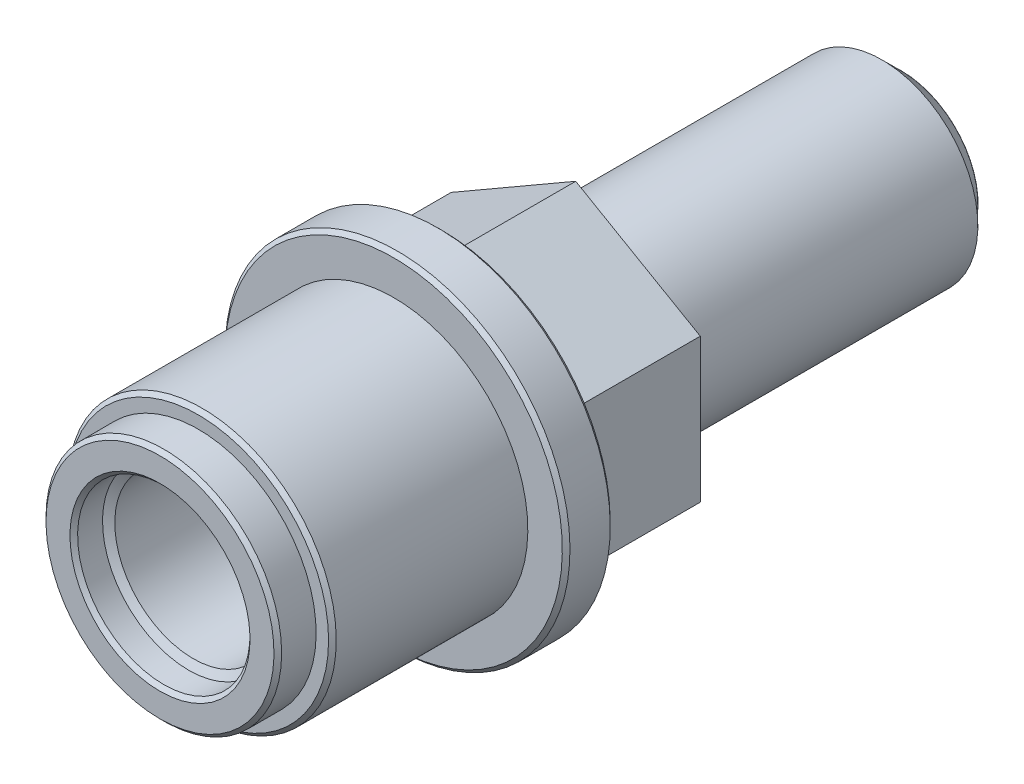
ISO-10303-21;
HEADER;
FILE_DESCRIPTION(('STEP AP214'),'2;1');
FILE_NAME('part.step','',(''),(''),'','','');
FILE_SCHEMA(('AUTOMOTIVE_DESIGN { 1 0 10303 214 1 1 1 1 }'));
ENDSEC;
DATA;
#1=APPLICATION_CONTEXT('core data for automotive mechanical design processes');
#2=APPLICATION_PROTOCOL_DEFINITION('international standard','automotive_design',2000,#1);
#3=PRODUCT_CONTEXT('',#1,'mechanical');
#4=PRODUCT('Part','Part','',(#3));
#5=PRODUCT_RELATED_PRODUCT_CATEGORY('part','',(#4));
#6=PRODUCT_DEFINITION_FORMATION('','',#4);
#7=PRODUCT_DEFINITION_CONTEXT('part definition',#1,'design');
#8=PRODUCT_DEFINITION('design','',#6,#7);
#9=PRODUCT_DEFINITION_SHAPE('','',#8);
#10=(LENGTH_UNIT() NAMED_UNIT(*) SI_UNIT(.MILLI.,.METRE.));
#11=(NAMED_UNIT(*) PLANE_ANGLE_UNIT() SI_UNIT($,.RADIAN.));
#12=(NAMED_UNIT(*) SI_UNIT($,.STERADIAN.) SOLID_ANGLE_UNIT());
#13=UNCERTAINTY_MEASURE_WITH_UNIT(LENGTH_MEASURE(1.E-05),#10,'distance_accuracy_value','');
#14=(GEOMETRIC_REPRESENTATION_CONTEXT(3) GLOBAL_UNCERTAINTY_ASSIGNED_CONTEXT((#13)) GLOBAL_UNIT_ASSIGNED_CONTEXT((#10,
#11,#12)) REPRESENTATION_CONTEXT('',''));
#15=CARTESIAN_POINT('',(0.,0.,0.));
#16=DIRECTION('',(0.,0.,1.));
#17=DIRECTION('',(1.,0.,0.));
#18=AXIS2_PLACEMENT_3D('',#15,#16,#17);
#19=CARTESIAN_POINT('',(-2.47104440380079,5.63173503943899,29.));
#20=DIRECTION('',(0.,0.,1.));
#21=DIRECTION('',(0.915729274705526,0.401795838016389,0.));
#22=AXIS2_PLACEMENT_3D('',#19,#20,#21);
#23=PLANE('',#22);
#24=CARTESIAN_POINT('',(0.,0.,29.));
#25=DIRECTION('',(0.,0.,1.));
#26=DIRECTION('',(0.915729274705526,0.401795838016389,0.));
#27=AXIS2_PLACEMENT_3D('',#24,#25,#26);
#28=CIRCLE('',#27,6.8);
#29=CARTESIAN_POINT('',(6.22695906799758,2.73221169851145,29.));
#30=VERTEX_POINT('',#29);
#31=EDGE_CURVE('E9',#30,#30,#28,.T.);
#32=ORIENTED_EDGE('',*,*,#31,.T.);
#33=EDGE_LOOP('',(#32));
#34=FACE_BOUND('',#33,.T.);
#35=CARTESIAN_POINT('',(0.,0.,29.));
#36=DIRECTION('',(0.,0.,-1.));
#37=DIRECTION('',(-0.915729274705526,-0.401795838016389,0.));
#38=AXIS2_PLACEMENT_3D('',#35,#36,#37);
#39=CIRCLE('',#38,6.15);
#40=CARTESIAN_POINT('',(-5.63173503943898,-2.47104440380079,29.));
#41=VERTEX_POINT('',#40);
#42=EDGE_CURVE('E145',#41,#41,#39,.T.);
#43=ORIENTED_EDGE('',*,*,#42,.T.);
#44=EDGE_LOOP('',(#43));
#45=FACE_BOUND('',#44,.T.);
#46=ADVANCED_FACE('F14',(#34,#45),#23,.T.);
#47=CARTESIAN_POINT('',(0.,0.,21.3));
#48=DIRECTION('',(0.,0.,-1.));
#49=DIRECTION('',(-0.915729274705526,-0.401795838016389,0.));
#50=AXIS2_PLACEMENT_3D('',#47,#48,#49);
#51=CYLINDRICAL_SURFACE('',#50,7.);
#52=CARTESIAN_POINT('',(0.,0.,28.8));
#53=DIRECTION('',(0.,0.,1.));
#54=DIRECTION('',(0.915729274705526,0.401795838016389,0.));
#55=AXIS2_PLACEMENT_3D('',#52,#53,#54);
#56=CIRCLE('',#55,7.);
#57=CARTESIAN_POINT('',(6.41010492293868,2.81257086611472,28.8));
#58=VERTEX_POINT('',#57);
#59=EDGE_CURVE('E23',#58,#58,#56,.F.);
#60=ORIENTED_EDGE('',*,*,#59,.T.);
#61=EDGE_LOOP('',(#60));
#62=FACE_BOUND('',#61,.T.);
#63=CARTESIAN_POINT('',(0.,0.,18.8));
#64=DIRECTION('',(0.,0.,-1.));
#65=DIRECTION('',(-0.866025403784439,0.5,0.));
#66=AXIS2_PLACEMENT_3D('',#63,#64,#65);
#67=CIRCLE('',#66,7.);
#68=CARTESIAN_POINT('',(-6.06217782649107,3.5,18.8));
#69=VERTEX_POINT('',#68);
#70=EDGE_CURVE('E123',#69,#69,#67,.T.);
#71=ORIENTED_EDGE('',*,*,#70,.F.);
#72=EDGE_LOOP('',(#71));
#73=FACE_BOUND('',#72,.T.);
#74=ADVANCED_FACE('F327',(#62,#73),#51,.T.);
#75=CARTESIAN_POINT('',(0.,0.,28.8));
#76=DIRECTION('',(0.,0.,-1.));
#77=DIRECTION('',(-0.915729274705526,-0.401795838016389,0.));
#78=AXIS2_PLACEMENT_3D('',#75,#76,#77);
#79=CONICAL_SURFACE('',#78,7.,0.785398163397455);
#80=ORIENTED_EDGE('',*,*,#31,.F.);
#81=EDGE_LOOP('',(#80));
#82=FACE_BOUND('',#81,.T.);
#83=ORIENTED_EDGE('',*,*,#59,.F.);
#84=EDGE_LOOP('',(#83));
#85=FACE_BOUND('',#84,.T.);
#86=ADVANCED_FACE('F311',(#82,#85),#79,.T.);
#87=CARTESIAN_POINT('',(0.,0.,-7.699));
#88=DIRECTION('',(0.,0.,1.));
#89=DIRECTION('',(0.866025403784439,-0.5,0.));
#90=AXIS2_PLACEMENT_3D('',#87,#88,#89);
#91=CONICAL_SURFACE('',#90,4.,0.785398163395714);
#92=CARTESIAN_POINT('',(0.,0.,-7.7));
#93=DIRECTION('',(0.,0.,1.));
#94=DIRECTION('',(0.866025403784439,-0.5,0.));
#95=AXIS2_PLACEMENT_3D('',#92,#93,#94);
#96=CIRCLE('',#95,3.999);
#97=CARTESIAN_POINT('',(3.46323558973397,-1.9995,-7.7));
#98=VERTEX_POINT('',#97);
#99=EDGE_CURVE('E114',#98,#98,#96,.F.);
#100=ORIENTED_EDGE('',*,*,#99,.F.);
#101=EDGE_LOOP('',(#100));
#102=FACE_BOUND('',#101,.T.);
#103=CARTESIAN_POINT('',(0.,0.,-7.699));
#104=DIRECTION('',(0.,0.,1.));
#105=DIRECTION('',(0.866025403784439,-0.5,0.));
#106=AXIS2_PLACEMENT_3D('',#103,#104,#105);
#107=CIRCLE('',#106,4.);
#108=CARTESIAN_POINT('',(3.46410161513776,-2.,-7.699));
#109=VERTEX_POINT('',#108);
#110=EDGE_CURVE('E111',#109,#109,#107,.T.);
#111=ORIENTED_EDGE('',*,*,#110,.F.);
#112=EDGE_LOOP('',(#111));
#113=FACE_BOUND('',#112,.T.);
#114=ADVANCED_FACE('F231',(#102,#113),#91,.T.);
#115=CARTESIAN_POINT('',(-3.46410161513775,2.,-7.7));
#116=DIRECTION('',(0.,0.,1.));
#117=DIRECTION('',(0.866025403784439,-0.5,0.));
#118=AXIS2_PLACEMENT_3D('',#115,#116,#117);
#119=PLANE('',#118);
#120=ORIENTED_EDGE('',*,*,#99,.T.);
#121=EDGE_LOOP('',(#120));
#122=FACE_BOUND('',#121,.T.);
#123=CARTESIAN_POINT('',(0.,0.,-7.7));
#124=DIRECTION('',(0.,0.,1.));
#125=DIRECTION('',(0.866025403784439,-0.5,0.));
#126=AXIS2_PLACEMENT_3D('',#123,#124,#125);
#127=CIRCLE('',#126,3.25);
#128=CARTESIAN_POINT('',(2.81458256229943,-1.625,-7.7));
#129=VERTEX_POINT('',#128);
#130=EDGE_CURVE('E108',#129,#129,#127,.T.);
#131=ORIENTED_EDGE('',*,*,#130,.T.);
#132=EDGE_LOOP('',(#131));
#133=FACE_BOUND('',#132,.T.);
#134=ADVANCED_FACE('F227',(#122,#133),#119,.F.);
#135=CARTESIAN_POINT('',(0.,0.,36.2946490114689));
#136=DIRECTION('',(0.,0.,1.));
#137=DIRECTION('',(0.866025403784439,-0.5,0.));
#138=AXIS2_PLACEMENT_3D('',#135,#136,#137);
#139=CYLINDRICAL_SURFACE('',#138,3.25);
#140=ORIENTED_EDGE('',*,*,#130,.F.);
#141=EDGE_LOOP('',(#140));
#142=FACE_BOUND('',#141,.T.);
#143=CARTESIAN_POINT('',(0.,0.,16.7439));
#144=DIRECTION('',(0.,0.,1.));
#145=DIRECTION('',(-0.5,-0.866025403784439,0.));
#146=AXIS2_PLACEMENT_3D('',#143,#144,#145);
#147=CIRCLE('',#146,3.25);
#148=CARTESIAN_POINT('',(-1.625,-2.81458256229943,16.7439));
#149=VERTEX_POINT('',#148);
#150=EDGE_CURVE('E155',#149,#149,#147,.T.);
#151=ORIENTED_EDGE('',*,*,#150,.T.);
#152=EDGE_LOOP('',(#151));
#153=FACE_BOUND('',#152,.T.);
#154=ADVANCED_FACE('F215',(#142,#153),#139,.F.);
#155=CARTESIAN_POINT('',(0.,0.,16.7439));
#156=DIRECTION('',(0.,0.,1.));
#157=DIRECTION('',(0.827844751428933,-0.560957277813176,0.));
#158=AXIS2_PLACEMENT_3D('',#155,#156,#157);
#159=PLANE('',#158);
#160=ORIENTED_EDGE('',*,*,#150,.F.);
#161=EDGE_LOOP('',(#160));
#162=FACE_BOUND('',#161,.T.);
#163=CARTESIAN_POINT('',(0.,0.,16.7439));
#164=DIRECTION('',(0.,0.,1.));
#165=DIRECTION('',(-0.5,-0.866025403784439,0.));
#166=AXIS2_PLACEMENT_3D('',#163,#164,#165);
#167=CIRCLE('',#166,4.1);
#168=CARTESIAN_POINT('',(-2.05,-3.5507041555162,16.7439));
#169=VERTEX_POINT('',#168);
#170=EDGE_CURVE('E18',#169,#169,#167,.T.);
#171=ORIENTED_EDGE('',*,*,#170,.T.);
#172=EDGE_LOOP('',(#171));
#173=FACE_BOUND('',#172,.T.);
#174=ADVANCED_FACE('F212',(#162,#173),#159,.T.);
#175=CARTESIAN_POINT('',(0.,0.,36.2946490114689));
#176=DIRECTION('',(0.,0.,1.));
#177=DIRECTION('',(0.866025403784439,-0.5,0.));
#178=AXIS2_PLACEMENT_3D('',#175,#176,#177);
#179=CYLINDRICAL_SURFACE('',#178,4.1);
#180=ORIENTED_EDGE('',*,*,#170,.F.);
#181=EDGE_LOOP('',(#180));
#182=FACE_BOUND('',#181,.T.);
#183=CARTESIAN_POINT('',(0.,0.,29.259655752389));
#184=DIRECTION('',(0.,0.,-1.));
#185=DIRECTION('',(-0.866025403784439,0.5,0.));
#186=AXIS2_PLACEMENT_3D('',#183,#184,#185);
#187=CIRCLE('',#186,4.1);
#188=CARTESIAN_POINT('',(-3.5507041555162,2.05,29.259655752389));
#189=VERTEX_POINT('',#188);
#190=EDGE_CURVE('E161',#189,#189,#187,.T.);
#191=ORIENTED_EDGE('',*,*,#190,.F.);
#192=EDGE_LOOP('',(#191));
#193=FACE_BOUND('',#192,.T.);
#194=ADVANCED_FACE('F214',(#182,#193),#179,.F.);
#195=CARTESIAN_POINT('',(0.,0.,29.5));
#196=DIRECTION('',(0.,0.,1.));
#197=DIRECTION('',(0.866025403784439,-0.5,0.));
#198=AXIS2_PLACEMENT_3D('',#195,#196,#197);
#199=CONICAL_SURFACE('',#198,4.5,1.02974425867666);
#200=ORIENTED_EDGE('',*,*,#190,.T.);
#201=EDGE_LOOP('',(#200));
#202=FACE_BOUND('',#201,.T.);
#203=CARTESIAN_POINT('',(0.,0.,29.5));
#204=DIRECTION('',(0.,0.,-1.));
#205=DIRECTION('',(-0.866025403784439,0.5,0.));
#206=AXIS2_PLACEMENT_3D('',#203,#204,#205);
#207=CIRCLE('',#206,4.5);
#208=CARTESIAN_POINT('',(-3.89711431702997,2.25,29.5));
#209=VERTEX_POINT('',#208);
#210=EDGE_CURVE('E164',#209,#209,#207,.T.);
#211=ORIENTED_EDGE('',*,*,#210,.F.);
#212=EDGE_LOOP('',(#211));
#213=FACE_BOUND('',#212,.T.);
#214=ADVANCED_FACE('F223',(#202,#213),#199,.F.);
#215=CARTESIAN_POINT('',(0.,0.,9.3));
#216=DIRECTION('',(0.,0.,-1.));
#217=DIRECTION('',(-0.866025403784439,0.5,0.));
#218=AXIS2_PLACEMENT_3D('',#215,#216,#217);
#219=CYLINDRICAL_SURFACE('',#218,4.5);
#220=CARTESIAN_POINT('',(0.,0.,30.8));
#221=DIRECTION('',(0.,0.,-1.));
#222=DIRECTION('',(-0.866025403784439,0.5,0.));
#223=AXIS2_PLACEMENT_3D('',#220,#221,#222);
#224=CIRCLE('',#223,4.5);
#225=CARTESIAN_POINT('',(-3.89711431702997,2.25,30.8));
#226=VERTEX_POINT('',#225);
#227=EDGE_CURVE('E140',#226,#226,#224,.F.);
#228=ORIENTED_EDGE('',*,*,#227,.T.);
#229=EDGE_LOOP('',(#228));
#230=FACE_BOUND('',#229,.T.);
#231=ORIENTED_EDGE('',*,*,#210,.T.);
#232=EDGE_LOOP('',(#231));
#233=FACE_BOUND('',#232,.T.);
#234=ADVANCED_FACE('F237',(#230,#233),#219,.F.);
#235=CARTESIAN_POINT('',(0.,0.,31.));
#236=DIRECTION('',(0.,0.,1.));
#237=DIRECTION('',(0.866025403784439,-0.5,0.));
#238=AXIS2_PLACEMENT_3D('',#235,#236,#237);
#239=CONICAL_SURFACE('',#238,4.7,0.785398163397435);
#240=ORIENTED_EDGE('',*,*,#227,.F.);
#241=EDGE_LOOP('',(#240));
#242=FACE_BOUND('',#241,.T.);
#243=CARTESIAN_POINT('',(0.,0.,31.));
#244=DIRECTION('',(0.,0.,-1.));
#245=DIRECTION('',(-0.866025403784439,0.5,0.));
#246=AXIS2_PLACEMENT_3D('',#243,#244,#245);
#247=CIRCLE('',#246,4.7);
#248=CARTESIAN_POINT('',(-4.07031939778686,2.35,31.));
#249=VERTEX_POINT('',#248);
#250=EDGE_CURVE('E138',#249,#249,#247,.T.);
#251=ORIENTED_EDGE('',*,*,#250,.F.);
#252=EDGE_LOOP('',(#251));
#253=FACE_BOUND('',#252,.T.);
#254=ADVANCED_FACE('F16',(#242,#253),#239,.F.);
#255=CARTESIAN_POINT('',(-5.3260562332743,3.075,31.));
#256=DIRECTION('',(0.,0.,-1.));
#257=DIRECTION('',(-0.866025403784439,0.5,0.));
#258=AXIS2_PLACEMENT_3D('',#255,#256,#257);
#259=PLANE('',#258);
#260=ORIENTED_EDGE('',*,*,#250,.T.);
#261=EDGE_LOOP('',(#260));
#262=FACE_BOUND('',#261,.T.);
#263=CARTESIAN_POINT('',(0.,0.,31.));
#264=DIRECTION('',(0.,0.,-1.));
#265=DIRECTION('',(-0.866025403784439,0.5,0.));
#266=AXIS2_PLACEMENT_3D('',#263,#264,#265);
#267=CIRCLE('',#266,5.95);
#268=CARTESIAN_POINT('',(-5.15285115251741,2.975,31.));
#269=VERTEX_POINT('',#268);
#270=EDGE_CURVE('E117',#269,#269,#267,.F.);
#271=ORIENTED_EDGE('',*,*,#270,.T.);
#272=EDGE_LOOP('',(#271));
#273=FACE_BOUND('',#272,.T.);
#274=ADVANCED_FACE('F236',(#262,#273),#259,.F.);
#275=CARTESIAN_POINT('',(0.,0.,31.));
#276=DIRECTION('',(0.,0.,-1.));
#277=DIRECTION('',(-0.866025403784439,0.5,0.));
#278=AXIS2_PLACEMENT_3D('',#275,#276,#277);
#279=CONICAL_SURFACE('',#278,5.95,0.785398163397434);
#280=CARTESIAN_POINT('',(0.,0.,30.8));
#281=DIRECTION('',(0.,0.,-1.));
#282=DIRECTION('',(-0.866025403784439,0.5,0.));
#283=AXIS2_PLACEMENT_3D('',#280,#281,#282);
#284=CIRCLE('',#283,6.15);
#285=CARTESIAN_POINT('',(-5.3260562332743,3.075,30.8));
#286=VERTEX_POINT('',#285);
#287=EDGE_CURVE('E120',#286,#286,#284,.T.);
#288=ORIENTED_EDGE('',*,*,#287,.F.);
#289=EDGE_LOOP('',(#288));
#290=FACE_BOUND('',#289,.T.);
#291=ORIENTED_EDGE('',*,*,#270,.F.);
#292=EDGE_LOOP('',(#291));
#293=FACE_BOUND('',#292,.T.);
#294=ADVANCED_FACE('F244',(#290,#293),#279,.T.);
#295=CARTESIAN_POINT('',(0.,0.,46.476972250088));
#296=DIRECTION('',(0.,0.,1.));
#297=DIRECTION('',(0.866025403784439,-0.5,0.));
#298=AXIS2_PLACEMENT_3D('',#295,#296,#297);
#299=CYLINDRICAL_SURFACE('',#298,6.15);
#300=ORIENTED_EDGE('',*,*,#42,.F.);
#301=EDGE_LOOP('',(#300));
#302=FACE_BOUND('',#301,.T.);
#303=ORIENTED_EDGE('',*,*,#287,.T.);
#304=EDGE_LOOP('',(#303));
#305=FACE_BOUND('',#304,.T.);
#306=ADVANCED_FACE('F247',(#302,#305),#299,.T.);
#307=CARTESIAN_POINT('',(0.,0.,46.476972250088));
#308=DIRECTION('',(0.,0.,1.));
#309=DIRECTION('',(0.866025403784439,-0.5,0.));
#310=AXIS2_PLACEMENT_3D('',#307,#308,#309);
#311=CYLINDRICAL_SURFACE('',#310,4.);
#312=ORIENTED_EDGE('',*,*,#110,.T.);
#313=EDGE_LOOP('',(#312));
#314=FACE_BOUND('',#313,.T.);
#315=CARTESIAN_POINT('',(0.,0.,-7.69));
#316=DIRECTION('',(0.,0.,-1.));
#317=DIRECTION('',(-0.866025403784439,0.5,0.));
#318=AXIS2_PLACEMENT_3D('',#315,#316,#317);
#319=CIRCLE('',#318,4.);
#320=CARTESIAN_POINT('',(-3.46410161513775,2.,-7.69));
#321=VERTEX_POINT('',#320);
#322=EDGE_CURVE('E105',#321,#321,#319,.T.);
#323=ORIENTED_EDGE('',*,*,#322,.T.);
#324=EDGE_LOOP('',(#323));
#325=FACE_BOUND('',#324,.T.);
#326=ADVANCED_FACE('F230',(#314,#325),#311,.T.);
#327=CARTESIAN_POINT('',(0.,0.,-7.69));
#328=DIRECTION('',(0.,0.,1.));
#329=DIRECTION('',(0.866025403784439,-0.5,0.));
#330=AXIS2_PLACEMENT_3D('',#327,#328,#329);
#331=CONICAL_SURFACE('',#330,4.,0.785398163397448);
#332=CARTESIAN_POINT('',(0.,0.,-6.69));
#333=DIRECTION('',(0.,0.,-1.));
#334=DIRECTION('',(-0.866025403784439,0.5,0.));
#335=AXIS2_PLACEMENT_3D('',#332,#333,#334);
#336=CIRCLE('',#335,5.);
#337=CARTESIAN_POINT('',(-4.33012701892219,2.5,-6.69));
#338=VERTEX_POINT('',#337);
#339=EDGE_CURVE('E102',#338,#338,#336,.T.);
#340=ORIENTED_EDGE('',*,*,#339,.T.);
#341=EDGE_LOOP('',(#340));
#342=FACE_BOUND('',#341,.T.);
#343=ORIENTED_EDGE('',*,*,#322,.F.);
#344=EDGE_LOOP('',(#343));
#345=FACE_BOUND('',#344,.T.);
#346=ADVANCED_FACE('F209',(#342,#345),#331,.T.);
#347=CARTESIAN_POINT('',(0.,0.,9.3));
#348=DIRECTION('',(0.,0.,-1.));
#349=DIRECTION('',(-0.866025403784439,0.5,0.));
#350=AXIS2_PLACEMENT_3D('',#347,#348,#349);
#351=CYLINDRICAL_SURFACE('',#350,5.);
#352=ORIENTED_EDGE('',*,*,#339,.F.);
#353=EDGE_LOOP('',(#352));
#354=FACE_BOUND('',#353,.T.);
#355=CARTESIAN_POINT('',(0.,0.,9.3));
#356=DIRECTION('',(0.,0.,-1.));
#357=DIRECTION('',(-0.866025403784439,0.5,0.));
#358=AXIS2_PLACEMENT_3D('',#355,#356,#357);
#359=CIRCLE('',#358,5.);
#360=CARTESIAN_POINT('',(-4.33012701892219,2.5,9.3));
#361=VERTEX_POINT('',#360);
#362=EDGE_CURVE('E158',#361,#361,#359,.F.);
#363=ORIENTED_EDGE('',*,*,#362,.F.);
#364=EDGE_LOOP('',(#363));
#365=FACE_BOUND('',#364,.T.);
#366=ADVANCED_FACE('F226',(#354,#365),#351,.T.);
#367=CARTESIAN_POINT('',(4.3301270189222,-2.5,9.3));
#368=DIRECTION('',(0.,0.,-1.));
#369=DIRECTION('',(-0.866025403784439,0.5,0.));
#370=AXIS2_PLACEMENT_3D('',#367,#368,#369);
#371=PLANE('',#370);
#372=DIRECTION('',(-0.866025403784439,0.5,0.));
#373=VECTOR('',#372,1.);
#374=CARTESIAN_POINT('',(0.,-7.50555349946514,9.3));
#375=LINE('',#374,#373);
#376=CARTESIAN_POINT('',(0.,-7.50555349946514,9.3));
#377=VERTEX_POINT('',#376);
#378=CARTESIAN_POINT('',(-6.5,-3.75277674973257,9.3));
#379=VERTEX_POINT('',#378);
#380=EDGE_CURVE('E91',#377,#379,#375,.T.);
#381=ORIENTED_EDGE('',*,*,#380,.T.);
#382=DIRECTION('',(0.,1.,0.));
#383=VECTOR('',#382,1.);
#384=CARTESIAN_POINT('',(-6.5,-3.75277674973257,9.3));
#385=LINE('',#384,#383);
#386=CARTESIAN_POINT('',(-6.5,3.75277674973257,9.3));
#387=VERTEX_POINT('',#386);
#388=EDGE_CURVE('E167',#379,#387,#385,.T.);
#389=ORIENTED_EDGE('',*,*,#388,.T.);
#390=DIRECTION('',(0.866025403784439,0.5,0.));
#391=VECTOR('',#390,1.);
#392=CARTESIAN_POINT('',(-6.5,3.75277674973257,9.3));
#393=LINE('',#392,#391);
#394=CARTESIAN_POINT('',(0.,7.50555349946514,9.3));
#395=VERTEX_POINT('',#394);
#396=EDGE_CURVE('E170',#387,#395,#393,.T.);
#397=ORIENTED_EDGE('',*,*,#396,.T.);
#398=DIRECTION('',(0.866025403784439,-0.5,0.));
#399=VECTOR('',#398,1.);
#400=CARTESIAN_POINT('',(0.,7.50555349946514,9.3));
#401=LINE('',#400,#399);
#402=CARTESIAN_POINT('',(6.5,3.75277674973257,9.3));
#403=VERTEX_POINT('',#402);
#404=EDGE_CURVE('E31',#395,#403,#401,.T.);
#405=ORIENTED_EDGE('',*,*,#404,.T.);
#406=DIRECTION('',(0.,-1.,0.));
#407=VECTOR('',#406,1.);
#408=CARTESIAN_POINT('',(6.5,3.75277674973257,9.3));
#409=LINE('',#408,#407);
#410=CARTESIAN_POINT('',(6.5,-3.75277674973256,9.3));
#411=VERTEX_POINT('',#410);
#412=EDGE_CURVE('E173',#403,#411,#409,.T.);
#413=ORIENTED_EDGE('',*,*,#412,.T.);
#414=DIRECTION('',(-0.866025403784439,-0.5,0.));
#415=VECTOR('',#414,1.);
#416=CARTESIAN_POINT('',(6.5,-3.75277674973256,9.3));
#417=LINE('',#416,#415);
#418=EDGE_CURVE('E176',#411,#377,#417,.T.);
#419=ORIENTED_EDGE('',*,*,#418,.T.);
#420=EDGE_LOOP('',(#381,#389,#397,#405,#413,#419));
#421=FACE_BOUND('',#420,.T.);
#422=ORIENTED_EDGE('',*,*,#362,.T.);
#423=EDGE_LOOP('',(#422));
#424=FACE_BOUND('',#423,.T.);
#425=ADVANCED_FACE('F193',(#421,#424),#371,.T.);
#426=CARTESIAN_POINT('',(0.,7.50555349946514,24.3));
#427=DIRECTION('',(0.5,0.866025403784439,0.));
#428=DIRECTION('',(-0.866025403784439,0.5,0.));
#429=AXIS2_PLACEMENT_3D('',#426,#427,#428);
#430=PLANE('',#429);
#431=DIRECTION('',(0.866025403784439,-0.5,0.));
#432=VECTOR('',#431,1.);
#433=CARTESIAN_POINT('',(-2.0760562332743,8.70416512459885,16.3));
#434=LINE('',#433,#432);
#435=CARTESIAN_POINT('',(0.,7.50555349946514,16.3));
#436=VERTEX_POINT('',#435);
#437=CARTESIAN_POINT('',(6.5,3.75277674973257,16.3));
#438=VERTEX_POINT('',#437);
#439=EDGE_CURVE('E77',#436,#438,#434,.T.);
#440=ORIENTED_EDGE('',*,*,#439,.T.);
#441=DIRECTION('',(0.,0.,-1.));
#442=VECTOR('',#441,1.);
#443=CARTESIAN_POINT('',(6.5,3.75277674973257,24.3));
#444=LINE('',#443,#442);
#445=EDGE_CURVE('E87',#438,#403,#444,.T.);
#446=ORIENTED_EDGE('',*,*,#445,.T.);
#447=ORIENTED_EDGE('',*,*,#404,.F.);
#448=DIRECTION('',(0.,0.,-1.));
#449=VECTOR('',#448,1.);
#450=CARTESIAN_POINT('',(0.,7.50555349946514,24.3));
#451=LINE('',#450,#449);
#452=EDGE_CURVE('E73',#436,#395,#451,.T.);
#453=ORIENTED_EDGE('',*,*,#452,.F.);
#454=EDGE_LOOP('',(#440,#446,#447,#453));
#455=FACE_BOUND('',#454,.T.);
#456=ADVANCED_FACE('F86',(#455),#430,.T.);
#457=CARTESIAN_POINT('',(6.5,3.75277674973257,24.3));
#458=DIRECTION('',(1.,0.,0.));
#459=DIRECTION('',(0.,1.,0.));
#460=AXIS2_PLACEMENT_3D('',#457,#458,#459);
#461=PLANE('',#460);
#462=DIRECTION('',(0.,-1.,0.));
#463=VECTOR('',#462,1.);
#464=CARTESIAN_POINT('',(6.5,3.075,16.3));
#465=LINE('',#464,#463);
#466=CARTESIAN_POINT('',(6.5,-3.75277674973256,16.3));
#467=VERTEX_POINT('',#466);
#468=EDGE_CURVE('E83',#438,#467,#465,.T.);
#469=ORIENTED_EDGE('',*,*,#468,.T.);
#470=DIRECTION('',(0.,0.,-1.));
#471=VECTOR('',#470,1.);
#472=CARTESIAN_POINT('',(6.5,-3.75277674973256,24.3));
#473=LINE('',#472,#471);
#474=EDGE_CURVE('E89',#467,#411,#473,.T.);
#475=ORIENTED_EDGE('',*,*,#474,.T.);
#476=ORIENTED_EDGE('',*,*,#412,.F.);
#477=ORIENTED_EDGE('',*,*,#445,.F.);
#478=EDGE_LOOP('',(#469,#475,#476,#477));
#479=FACE_BOUND('',#478,.T.);
#480=ADVANCED_FACE('F187',(#479),#461,.T.);
#481=CARTESIAN_POINT('',(6.5,-3.75277674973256,24.3));
#482=DIRECTION('',(0.5,-0.866025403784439,0.));
#483=DIRECTION('',(0.866025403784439,0.5,0.));
#484=AXIS2_PLACEMENT_3D('',#481,#482,#483);
#485=PLANE('',#484);
#486=DIRECTION('',(-0.866025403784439,-0.5,0.));
#487=VECTOR('',#486,1.);
#488=CARTESIAN_POINT('',(0.586971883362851,-7.16666512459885,16.3));
#489=LINE('',#488,#487);
#490=CARTESIAN_POINT('',(0.,-7.50555349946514,16.3));
#491=VERTEX_POINT('',#490);
#492=EDGE_CURVE('E96',#467,#491,#489,.T.);
#493=ORIENTED_EDGE('',*,*,#492,.T.);
#494=DIRECTION('',(0.,0.,-1.));
#495=VECTOR('',#494,1.);
#496=CARTESIAN_POINT('',(0.,-7.50555349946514,24.3));
#497=LINE('',#496,#495);
#498=EDGE_CURVE('E182',#491,#377,#497,.T.);
#499=ORIENTED_EDGE('',*,*,#498,.T.);
#500=ORIENTED_EDGE('',*,*,#418,.F.);
#501=ORIENTED_EDGE('',*,*,#474,.F.);
#502=EDGE_LOOP('',(#493,#499,#500,#501));
#503=FACE_BOUND('',#502,.T.);
#504=ADVANCED_FACE('F189',(#503),#485,.T.);
#505=CARTESIAN_POINT('',(0.,-7.50555349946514,24.3));
#506=DIRECTION('',(-0.5,-0.866025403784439,0.));
#507=DIRECTION('',(0.,0.,-1.));
#508=AXIS2_PLACEMENT_3D('',#505,#506,#507);
#509=PLANE('',#508);
#510=DIRECTION('',(-0.866025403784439,0.5,0.));
#511=VECTOR('',#510,1.);
#512=CARTESIAN_POINT('',(-8.5760562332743,-2.55416512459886,16.3));
#513=LINE('',#512,#511);
#514=CARTESIAN_POINT('',(-6.5,-3.75277674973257,16.3));
#515=VERTEX_POINT('',#514);
#516=EDGE_CURVE('E98',#491,#515,#513,.T.);
#517=ORIENTED_EDGE('',*,*,#516,.T.);
#518=DIRECTION('',(0.,0.,-1.));
#519=VECTOR('',#518,1.);
#520=CARTESIAN_POINT('',(-6.5,-3.75277674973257,24.3));
#521=LINE('',#520,#519);
#522=EDGE_CURVE('E78',#515,#379,#521,.T.);
#523=ORIENTED_EDGE('',*,*,#522,.T.);
#524=ORIENTED_EDGE('',*,*,#380,.F.);
#525=ORIENTED_EDGE('',*,*,#498,.F.);
#526=EDGE_LOOP('',(#517,#523,#524,#525));
#527=FACE_BOUND('',#526,.T.);
#528=ADVANCED_FACE('F198',(#527),#509,.T.);
#529=CARTESIAN_POINT('',(-6.5,-3.75277674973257,24.3));
#530=DIRECTION('',(-1.,0.,0.));
#531=DIRECTION('',(0.,-1.,0.));
#532=AXIS2_PLACEMENT_3D('',#529,#530,#531);
#533=PLANE('',#532);
#534=DIRECTION('',(0.,1.,0.));
#535=VECTOR('',#534,1.);
#536=CARTESIAN_POINT('',(-6.5,3.075,16.3));
#537=LINE('',#536,#535);
#538=CARTESIAN_POINT('',(-6.5,3.75277674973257,16.3));
#539=VERTEX_POINT('',#538);
#540=EDGE_CURVE('E100',#515,#539,#537,.T.);
#541=ORIENTED_EDGE('',*,*,#540,.T.);
#542=DIRECTION('',(0.,0.,-1.));
#543=VECTOR('',#542,1.);
#544=CARTESIAN_POINT('',(-6.5,3.75277674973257,24.3));
#545=LINE('',#544,#543);
#546=EDGE_CURVE('E39',#539,#387,#545,.T.);
#547=ORIENTED_EDGE('',*,*,#546,.T.);
#548=ORIENTED_EDGE('',*,*,#388,.F.);
#549=ORIENTED_EDGE('',*,*,#522,.F.);
#550=EDGE_LOOP('',(#541,#547,#548,#549));
#551=FACE_BOUND('',#550,.T.);
#552=ADVANCED_FACE('F196',(#551),#533,.T.);
#553=CARTESIAN_POINT('',(-6.5,3.75277674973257,24.3));
#554=DIRECTION('',(-0.5,0.866025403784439,0.));
#555=DIRECTION('',(-0.866025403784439,-0.5,0.));
#556=AXIS2_PLACEMENT_3D('',#553,#554,#555);
#557=PLANE('',#556);
#558=DIRECTION('',(0.866025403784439,0.5,0.));
#559=VECTOR('',#558,1.);
#560=CARTESIAN_POINT('',(-5.91302811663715,4.09166512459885,16.3));
#561=LINE('',#560,#559);
#562=EDGE_CURVE('E70',#539,#436,#561,.T.);
#563=ORIENTED_EDGE('',*,*,#562,.T.);
#564=ORIENTED_EDGE('',*,*,#452,.T.);
#565=ORIENTED_EDGE('',*,*,#396,.F.);
#566=ORIENTED_EDGE('',*,*,#546,.F.);
#567=EDGE_LOOP('',(#563,#564,#565,#566));
#568=FACE_BOUND('',#567,.T.);
#569=ADVANCED_FACE('F72',(#568),#557,.T.);
#570=CARTESIAN_POINT('',(5.3260562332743,-3.075,16.3));
#571=DIRECTION('',(0.,0.,1.));
#572=DIRECTION('',(0.866025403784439,-0.5,0.));
#573=AXIS2_PLACEMENT_3D('',#570,#571,#572);
#574=PLANE('',#573);
#575=CARTESIAN_POINT('',(0.,0.,16.3));
#576=DIRECTION('',(0.,0.,1.));
#577=DIRECTION('',(0.866025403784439,-0.5,0.));
#578=AXIS2_PLACEMENT_3D('',#575,#576,#577);
#579=CIRCLE('',#578,8.8);
#580=CARTESIAN_POINT('',(7.62102355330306,-4.4,16.3));
#581=VERTEX_POINT('',#580);
#582=EDGE_CURVE('E135',#581,#581,#579,.F.);
#583=ORIENTED_EDGE('',*,*,#582,.T.);
#584=EDGE_LOOP('',(#583));
#585=FACE_BOUND('',#584,.T.);
#586=ORIENTED_EDGE('',*,*,#562,.F.);
#587=ORIENTED_EDGE('',*,*,#540,.F.);
#588=ORIENTED_EDGE('',*,*,#516,.F.);
#589=ORIENTED_EDGE('',*,*,#492,.F.);
#590=ORIENTED_EDGE('',*,*,#468,.F.);
#591=ORIENTED_EDGE('',*,*,#439,.F.);
#592=EDGE_LOOP('',(#586,#587,#588,#589,#590,#591));
#593=FACE_BOUND('',#592,.T.);
#594=ADVANCED_FACE('F81',(#585,#593),#574,.F.);
#595=CARTESIAN_POINT('',(0.,0.,16.3));
#596=DIRECTION('',(0.,0.,1.));
#597=DIRECTION('',(0.866025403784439,-0.5,0.));
#598=AXIS2_PLACEMENT_3D('',#595,#596,#597);
#599=CONICAL_SURFACE('',#598,8.8,0.78539816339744);
#600=CARTESIAN_POINT('',(0.,0.,16.5));
#601=DIRECTION('',(0.,0.,1.));
#602=DIRECTION('',(0.866025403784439,-0.5,0.));
#603=AXIS2_PLACEMENT_3D('',#600,#601,#602);
#604=CIRCLE('',#603,9.);
#605=CARTESIAN_POINT('',(7.79422863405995,-4.5,16.5));
#606=VERTEX_POINT('',#605);
#607=EDGE_CURVE('E126',#606,#606,#604,.T.);
#608=ORIENTED_EDGE('',*,*,#607,.F.);
#609=EDGE_LOOP('',(#608));
#610=FACE_BOUND('',#609,.T.);
#611=ORIENTED_EDGE('',*,*,#582,.F.);
#612=EDGE_LOOP('',(#611));
#613=FACE_BOUND('',#612,.T.);
#614=ADVANCED_FACE('F249',(#610,#613),#599,.T.);
#615=CARTESIAN_POINT('',(0.,0.,9.3));
#616=DIRECTION('',(0.,0.,-1.));
#617=DIRECTION('',(-0.866025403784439,0.5,0.));
#618=AXIS2_PLACEMENT_3D('',#615,#616,#617);
#619=CYLINDRICAL_SURFACE('',#618,9.);
#620=CARTESIAN_POINT('',(0.,0.,18.6));
#621=DIRECTION('',(0.,0.,-1.));
#622=DIRECTION('',(-0.866025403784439,0.5,0.));
#623=AXIS2_PLACEMENT_3D('',#620,#621,#622);
#624=CIRCLE('',#623,9.);
#625=CARTESIAN_POINT('',(-7.79422863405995,4.5,18.6));
#626=VERTEX_POINT('',#625);
#627=EDGE_CURVE('E129',#626,#626,#624,.T.);
#628=ORIENTED_EDGE('',*,*,#627,.T.);
#629=EDGE_LOOP('',(#628));
#630=FACE_BOUND('',#629,.T.);
#631=ORIENTED_EDGE('',*,*,#607,.T.);
#632=EDGE_LOOP('',(#631));
#633=FACE_BOUND('',#632,.T.);
#634=ADVANCED_FACE('F263',(#630,#633),#619,.T.);
#635=CARTESIAN_POINT('',(0.,0.,18.6));
#636=DIRECTION('',(0.,0.,-1.));
#637=DIRECTION('',(-0.866025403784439,0.5,0.));
#638=AXIS2_PLACEMENT_3D('',#635,#636,#637);
#639=CONICAL_SURFACE('',#638,9.,0.785398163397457);
#640=CARTESIAN_POINT('',(0.,0.,18.8));
#641=DIRECTION('',(0.,0.,-1.));
#642=DIRECTION('',(-0.866025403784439,0.5,0.));
#643=AXIS2_PLACEMENT_3D('',#640,#641,#642);
#644=CIRCLE('',#643,8.8);
#645=CARTESIAN_POINT('',(-7.62102355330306,4.4,18.8));
#646=VERTEX_POINT('',#645);
#647=EDGE_CURVE('E132',#646,#646,#644,.F.);
#648=ORIENTED_EDGE('',*,*,#647,.F.);
#649=EDGE_LOOP('',(#648));
#650=FACE_BOUND('',#649,.T.);
#651=ORIENTED_EDGE('',*,*,#627,.F.);
#652=EDGE_LOOP('',(#651));
#653=FACE_BOUND('',#652,.T.);
#654=ADVANCED_FACE('F261',(#650,#653),#639,.T.);
#655=CARTESIAN_POINT('',(6.06217782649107,-3.5,18.8));
#656=DIRECTION('',(0.,0.,-1.));
#657=DIRECTION('',(-0.866025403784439,0.5,0.));
#658=AXIS2_PLACEMENT_3D('',#655,#656,#657);
#659=PLANE('',#658);
#660=ORIENTED_EDGE('',*,*,#647,.T.);
#661=EDGE_LOOP('',(#660));
#662=FACE_BOUND('',#661,.T.);
#663=ORIENTED_EDGE('',*,*,#70,.T.);
#664=EDGE_LOOP('',(#663));
#665=FACE_BOUND('',#664,.T.);
#666=ADVANCED_FACE('F258',(#662,#665),#659,.F.);
#667=CLOSED_SHELL('',(#46,#74,#86,#114,#134,#154,#174,#194,#214,#234,#254,#274,#294,#306,#326,
#346,#366,#425,#456,#480,#504,#528,#552,#569,#594,#614,#634,#654,#666));
#668=MANIFOLD_SOLID_BREP('B1',#667);
#669=ADVANCED_BREP_SHAPE_REPRESENTATION('',(#18,#668),#14);
#670=SHAPE_DEFINITION_REPRESENTATION(#9,#669);
ENDSEC;
END-ISO-10303-21;
